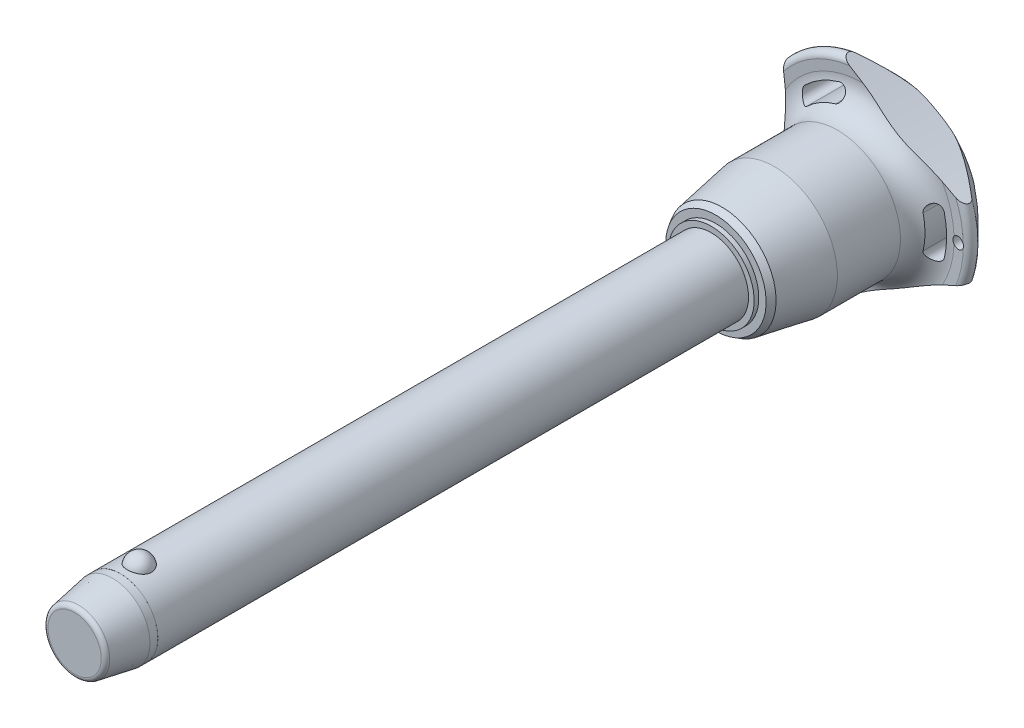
from build123d import *

# Parameters (mm, degrees)
SKETCH1_R           = 10
BOSS_EXTRUDE1_DEPTH = 150
SKETCH2_R           = 8.75
BOSS_EXTRUDE2_DEPTH = 50.7
BOSS_EXTRUDE3_START = 20.5
SKETCH1_2_R         = 10
BOSS_EXTRUDE3_DEPTH = 20.5
CHAMFER1_SIZE       = 10.25
CHAMFER1_SIZE2      = 1.807351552
FILLET1_R           = 1.25
SKETCH6_R           = 176.92625
CUT_EXTRUDE1_DEPTH  = 205.721493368
CIRPATTERN1_COUNT   = 3
SKETCH7_R           = 1.5
CUT_EXTRUDE2_DEPTH  = 205.647121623
SKETCH8_R           = 10
SKETCH8_R_2         = 9.99
CUT_EXTRUDE3_DEPTH  = 12.3


with BuildPart() as part:
    # Sketch1 → Boss-Extrude1 (new body)
    with BuildSketch(Plane.XY):
        Circle(SKETCH1_R)
    extrude(amount=-BOSS_EXTRUDE1_DEPTH)

    # Sketch2 → Boss-Extrude2 (add)
    with BuildSketch(Plane(origin=(0, 0, -150), x_dir=(-1, 0, 0), z_dir=(0, 0, -1))):
        with Locations(Location((0, 0, 0), (0, 0, 180))):
            Circle(SKETCH2_R)
    extrude(amount=BOSS_EXTRUDE2_DEPTH)

    # Sketch3 → Revolve1 (revolve)
    with BuildSketch(Plane(origin=(0, 0, 0), x_dir=(0, 0, -1), z_dir=(1, 0, 0))):
        with BuildLine():
            Line((-3.201562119, 12.5), (-3.201562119, 5.9))
            ThreePointArc((-3.201562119, 5.9), (0.098437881, 9.2), (-3.201562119, 12.5))
        make_face()
        with BuildLine():
            Line((-3.201562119, -5.9), (-3.201562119, -12.5))
            ThreePointArc((-3.201562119, -12.5), (0.098437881, -9.2), (-3.201562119, -5.9))
        make_face()
    revolve(axis=Axis((0, -5.9, 3.201562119), (0, 1, 0)))

    # Sketch1_2 → Boss-Extrude3 (add)
    with BuildSketch(Plane.XY.offset(BOSS_EXTRUDE3_START)):
        Circle(SKETCH1_2_R)
    extrude(amount=-BOSS_EXTRUDE3_DEPTH)

    # Chamfer1
    chamfer1_edges = [part.edges().sort_by_distance(p)[0] for p in [
        (-10, 0, 20.5),
    ]]
    chamfer1_side = [part.faces().sort_by_distance(p)[0] for p in [
        (-10, 0, -64.75),
    ]]
    chamfer(chamfer1_edges, length=CHAMFER1_SIZE, length2=CHAMFER1_SIZE2, reference=chamfer1_side[0])

    # Fillet1
    fillet1_edges = [part.edges().sort_by_distance(p)[0] for p in [
        (-8.192648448, 0, 20.5),
        (-8.75, 0, -200.7),
    ]]
    fillet(fillet1_edges, radius=FILLET1_R)

    # Sketch4 → Revolve2 (revolve)
    with BuildSketch(Plane(origin=(0, 0, 0), x_dir=(0, 0, -1), z_dir=(1, 0, 0)), mode=Mode.PRIVATE) as revolve2_sk:
        Polygon((150, 0), (150, 11.504815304), (151.25, 11.504815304), (151.25, 13.461079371), (152.944174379, 14.439211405), (166.9, 16.9), (183.8, 16.9), (183.8, 0), align=None)
    revolve(revolve2_sk.sketch.rotate(Axis((0, 0, -183.8), (0, 0, 1)), 90), axis=Axis((0, 0, -183.8), (0, 0, 1)))

    # Sketch5 → Revolve3 (revolve)
    with BuildSketch(Plane(origin=(0, 0, 0), x_dir=(0, 0, -1), z_dir=(1, 0, 0)), mode=Mode.PRIVATE) as revolve3_sk:
        with BuildLine():
            Line((190.790129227, 24.271609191), (190.652256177, 26.865060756))
            ThreePointArc((190.652256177, 26.865060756), (191.598671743, 28.411427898), (193.38137085, 28.08137085))
            Line((193.38137085, 28.08137085), (199.763226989, 21.69951471))
            ThreePointArc((199.763226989, 21.69951471), (200.7, 19.381044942), (199.683055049, 17.096604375))
            ThreePointArc((199.683055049, 17.096604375), (194.18864484, 9.321268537), (192.25, 0))
            Line((192.25, 0), (183.8, 0))
            Line((183.8, 0), (183.8, 16.9))
            ThreePointArc((183.8, 16.9), (188.879432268, 19.083427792), (190.790129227, 24.271609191))
        make_face()
    revolve(revolve3_sk.sketch.rotate(Axis((0, 0, -192.25), (0, 0, 1)), 90), axis=Axis((0, 0, -192.25), (0, 0, 1)))

    # Sketch6 → Cut-Extrude1 (cut, through all)
    with BuildSketch(Plane.XY):
        with Locations((-197.42625, 0)):
            Circle(SKETCH6_R)
        with BuildLine():
            ThreePointArc((21.802992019, -5.260839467), (22.428706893, 0), (21.802992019, 5.260839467))
            ThreePointArc((21.802992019, 5.260839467), (19.579234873, 6.620060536), (18.220013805, 4.39630339))
            ThreePointArc((18.220013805, 4.39630339), (18.742902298, 0), (18.220013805, -4.39630339))
            ThreePointArc((18.220013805, -4.39630339), (19.579234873, -6.620060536), (21.802992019, -5.260839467))
        make_face()
    cut_extrude1 = extrude(amount=-CUT_EXTRUDE1_DEPTH, mode=Mode.SUBTRACT)

    # CirPattern1: Cut-Extrude1 ×3 about axis
    cirpattern1_axis = Axis((0, 0, 0), (0, 0, 1))
    for i in range(1, CIRPATTERN1_COUNT):
        add(cut_extrude1.rotate(cirpattern1_axis, i * 360 / CIRPATTERN1_COUNT), mode=Mode.SUBTRACT)

    # Sketch7 → Cut-Extrude2 (cut, through all)
    with BuildSketch(Plane.XY):
        with Locations(Location((25.428706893, 0, 0), (0, 0, 17.230769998))):
            Circle(SKETCH7_R)
    extrude(amount=-CUT_EXTRUDE2_DEPTH, mode=Mode.SUBTRACT)

    # Sketch8 → Cut-Extrude3 (cut)
    with BuildSketch(Plane.XY.offset(20.5)):
        Circle(SKETCH8_R)
        Circle(SKETCH8_R_2, mode=Mode.SUBTRACT)
    extrude(amount=-CUT_EXTRUDE3_DEPTH, mode=Mode.SUBTRACT)


solid = part.part
